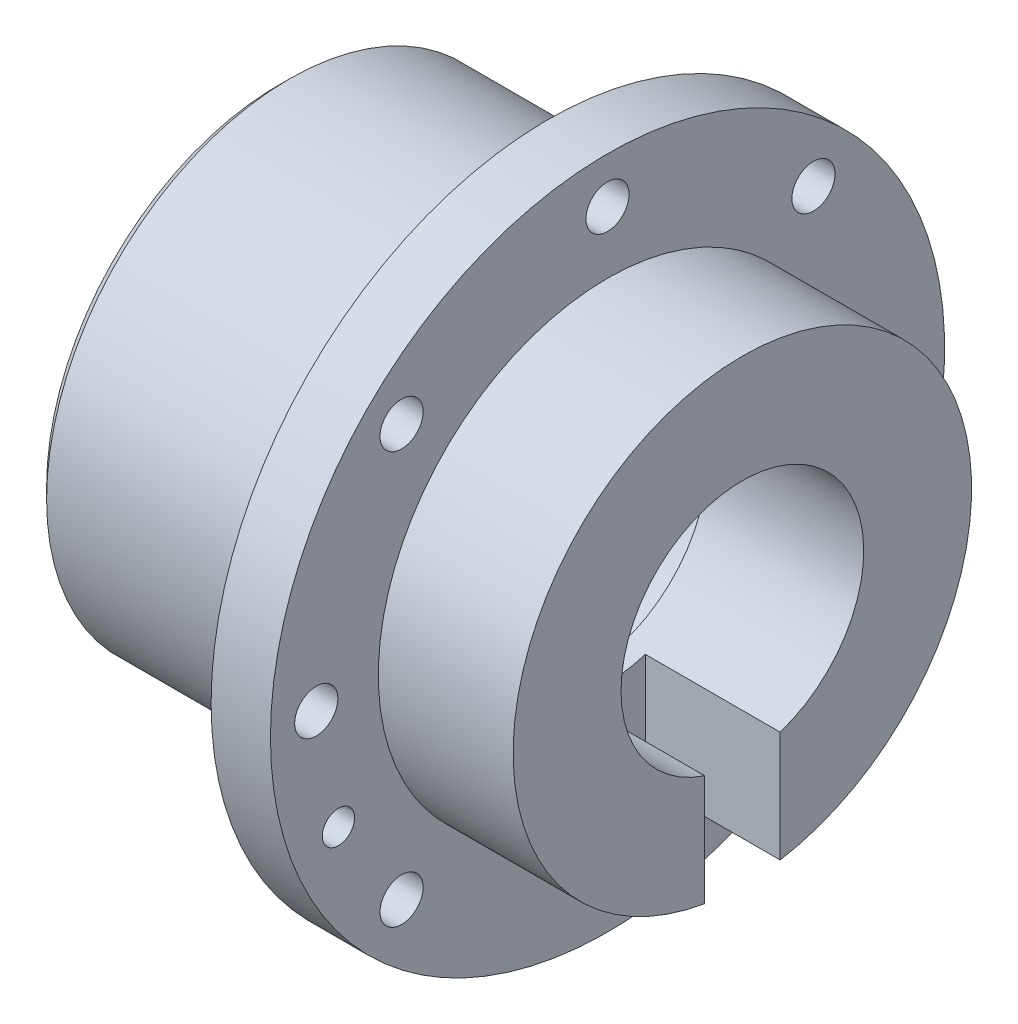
ISO-10303-21;
HEADER;
FILE_DESCRIPTION(('STEP AP214'),'2;1');
FILE_NAME('part.step','',(''),(''),'','','');
FILE_SCHEMA(('AUTOMOTIVE_DESIGN { 1 0 10303 214 1 1 1 1 }'));
ENDSEC;
DATA;
#1=APPLICATION_CONTEXT('core data for automotive mechanical design processes');
#2=APPLICATION_PROTOCOL_DEFINITION('international standard','automotive_design',2000,#1);
#3=PRODUCT_CONTEXT('',#1,'mechanical');
#4=PRODUCT('Part','Part','',(#3));
#5=PRODUCT_RELATED_PRODUCT_CATEGORY('part','',(#4));
#6=PRODUCT_DEFINITION_FORMATION('','',#4);
#7=PRODUCT_DEFINITION_CONTEXT('part definition',#1,'design');
#8=PRODUCT_DEFINITION('design','',#6,#7);
#9=PRODUCT_DEFINITION_SHAPE('','',#8);
#10=(LENGTH_UNIT() NAMED_UNIT(*) SI_UNIT(.MILLI.,.METRE.));
#11=(NAMED_UNIT(*) PLANE_ANGLE_UNIT() SI_UNIT($,.RADIAN.));
#12=(NAMED_UNIT(*) SI_UNIT($,.STERADIAN.) SOLID_ANGLE_UNIT());
#13=UNCERTAINTY_MEASURE_WITH_UNIT(LENGTH_MEASURE(1.E-05),#10,'distance_accuracy_value','');
#14=(GEOMETRIC_REPRESENTATION_CONTEXT(3) GLOBAL_UNCERTAINTY_ASSIGNED_CONTEXT((#13)) GLOBAL_UNIT_ASSIGNED_CONTEXT((#10,
#11,#12)) REPRESENTATION_CONTEXT('',''));
#15=CARTESIAN_POINT('',(0.,0.,0.));
#16=DIRECTION('',(0.,0.,1.));
#17=DIRECTION('',(1.,0.,0.));
#18=AXIS2_PLACEMENT_3D('',#15,#16,#17);
#19=CARTESIAN_POINT('',(59.2952543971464,62.5,0.));
#20=DIRECTION('',(-1.,0.,0.));
#21=DIRECTION('',(0.,0.,1.));
#22=AXIS2_PLACEMENT_3D('',#19,#20,#21);
#23=PLANE('',#22);
#24=CARTESIAN_POINT('',(59.2952543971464,38.1837661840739,-38.1837661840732));
#25=DIRECTION('',(1.,0.,0.));
#26=DIRECTION('',(0.,0.,-1.));
#27=AXIS2_PLACEMENT_3D('',#24,#25,#26);
#28=CIRCLE('',#27,3.99999999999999);
#29=CARTESIAN_POINT('',(59.2952543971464,38.1837661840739,-42.1837661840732));
#30=VERTEX_POINT('',#29);
#31=EDGE_CURVE('E233',#30,#30,#28,.T.);
#32=ORIENTED_EDGE('',*,*,#31,.F.);
#33=EDGE_LOOP('',(#32));
#34=FACE_BOUND('',#33,.T.);
#35=CARTESIAN_POINT('',(59.2952543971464,-38.1837661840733,-38.1837661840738));
#36=DIRECTION('',(1.,0.,0.));
#37=DIRECTION('',(0.,0.,-1.));
#38=AXIS2_PLACEMENT_3D('',#35,#36,#37);
#39=CIRCLE('',#38,3.99999999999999);
#40=CARTESIAN_POINT('',(59.2952543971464,-38.1837661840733,-42.1837661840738));
#41=VERTEX_POINT('',#40);
#42=EDGE_CURVE('E243',#41,#41,#39,.T.);
#43=ORIENTED_EDGE('',*,*,#42,.F.);
#44=EDGE_LOOP('',(#43));
#45=FACE_BOUND('',#44,.T.);
#46=CARTESIAN_POINT('',(59.2952543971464,38.1837661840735,38.1837661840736));
#47=DIRECTION('',(1.,0.,0.));
#48=DIRECTION('',(0.,0.,-1.));
#49=AXIS2_PLACEMENT_3D('',#46,#47,#48);
#50=CIRCLE('',#49,3.99999999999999);
#51=CARTESIAN_POINT('',(59.2952543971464,38.1837661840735,34.1837661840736));
#52=VERTEX_POINT('',#51);
#53=EDGE_CURVE('E257',#52,#52,#50,.T.);
#54=ORIENTED_EDGE('',*,*,#53,.F.);
#55=EDGE_LOOP('',(#54));
#56=FACE_BOUND('',#55,.T.);
#57=CARTESIAN_POINT('',(59.2952543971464,54.,0.));
#58=DIRECTION('',(1.,0.,0.));
#59=DIRECTION('',(0.,0.,-1.));
#60=AXIS2_PLACEMENT_3D('',#57,#58,#59);
#61=CIRCLE('',#60,4.);
#62=CARTESIAN_POINT('',(59.2952543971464,54.,-4.));
#63=VERTEX_POINT('',#62);
#64=EDGE_CURVE('E263',#63,#63,#61,.T.);
#65=ORIENTED_EDGE('',*,*,#64,.F.);
#66=EDGE_LOOP('',(#65));
#67=FACE_BOUND('',#66,.T.);
#68=DIRECTION('',(0.,-1.,0.));
#69=VECTOR('',#68,1.);
#70=CARTESIAN_POINT('',(59.2952543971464,-13.1016719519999,7.));
#71=LINE('',#70,#69);
#72=CARTESIAN_POINT('',(59.2952543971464,-21.3834047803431,7.));
#73=VERTEX_POINT('',#72);
#74=CARTESIAN_POINT('',(59.2952543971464,-41.9195658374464,6.99999999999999));
#75=VERTEX_POINT('',#74);
#76=EDGE_CURVE('E79',#73,#75,#71,.T.);
#77=ORIENTED_EDGE('',*,*,#76,.T.);
#78=CARTESIAN_POINT('',(59.2952543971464,0.,0.));
#79=DIRECTION('',(-1.,0.,0.));
#80=DIRECTION('',(0.,0.,1.));
#81=AXIS2_PLACEMENT_3D('',#78,#79,#80);
#82=CIRCLE('',#81,42.5);
#83=CARTESIAN_POINT('',(59.2952543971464,-41.9195658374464,-7.00000000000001));
#84=VERTEX_POINT('',#83);
#85=EDGE_CURVE('E99',#75,#84,#82,.T.);
#86=ORIENTED_EDGE('',*,*,#85,.T.);
#87=DIRECTION('',(0.,1.,0.));
#88=VECTOR('',#87,1.);
#89=CARTESIAN_POINT('',(59.2952543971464,-13.1016719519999,-7.));
#90=LINE('',#89,#88);
#91=CARTESIAN_POINT('',(59.2952543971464,-21.3834047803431,-7.));
#92=VERTEX_POINT('',#91);
#93=EDGE_CURVE('E51',#84,#92,#90,.T.);
#94=ORIENTED_EDGE('',*,*,#93,.T.);
#95=CARTESIAN_POINT('',(59.2952543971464,0.,0.));
#96=DIRECTION('',(1.,0.,0.));
#97=DIRECTION('',(0.,0.,-1.));
#98=AXIS2_PLACEMENT_3D('',#95,#96,#97);
#99=CIRCLE('',#98,22.5);
#100=EDGE_CURVE('E113',#92,#73,#99,.F.);
#101=ORIENTED_EDGE('',*,*,#100,.T.);
#102=EDGE_LOOP('',(#77,#86,#94,#101));
#103=FACE_BOUND('',#102,.T.);
#104=CARTESIAN_POINT('',(59.2952543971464,0.,0.));
#105=DIRECTION('',(-1.,0.,0.));
#106=DIRECTION('',(0.,0.,1.));
#107=AXIS2_PLACEMENT_3D('',#104,#105,#106);
#108=CIRCLE('',#107,62.5);
#109=CARTESIAN_POINT('',(59.2952543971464,0.,62.5));
#110=VERTEX_POINT('',#109);
#111=EDGE_CURVE('E107',#110,#110,#108,.T.);
#112=ORIENTED_EDGE('',*,*,#111,.F.);
#113=EDGE_LOOP('',(#112));
#114=FACE_BOUND('',#113,.T.);
#115=CARTESIAN_POINT('',(59.2952543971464,-1.405784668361E-13,54.));
#116=DIRECTION('',(1.,0.,0.));
#117=DIRECTION('',(0.,0.,-1.));
#118=AXIS2_PLACEMENT_3D('',#115,#116,#117);
#119=CIRCLE('',#118,3.99999999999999);
#120=CARTESIAN_POINT('',(59.2952543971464,-1.405784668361E-13,50.));
#121=VERTEX_POINT('',#120);
#122=EDGE_CURVE('E209',#121,#121,#119,.T.);
#123=ORIENTED_EDGE('',*,*,#122,.F.);
#124=EDGE_LOOP('',(#123));
#125=FACE_BOUND('',#124,.T.);
#126=CARTESIAN_POINT('',(59.2952543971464,-38.1837661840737,38.1837661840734));
#127=DIRECTION('',(1.,0.,0.));
#128=DIRECTION('',(0.,0.,-1.));
#129=AXIS2_PLACEMENT_3D('',#126,#127,#128);
#130=CIRCLE('',#129,4.);
#131=CARTESIAN_POINT('',(59.2952543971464,-38.1837661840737,34.1837661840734));
#132=VERTEX_POINT('',#131);
#133=EDGE_CURVE('E213',#132,#132,#130,.T.);
#134=ORIENTED_EDGE('',*,*,#133,.F.);
#135=EDGE_LOOP('',(#134));
#136=FACE_BOUND('',#135,.T.);
#137=CARTESIAN_POINT('',(59.2952543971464,4.217354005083E-13,-54.));
#138=DIRECTION('',(1.,0.,0.));
#139=DIRECTION('',(0.,0.,-1.));
#140=AXIS2_PLACEMENT_3D('',#137,#138,#139);
#141=CIRCLE('',#140,3.99999999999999);
#142=CARTESIAN_POINT('',(59.2952543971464,4.217354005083E-13,-58.));
#143=VERTEX_POINT('',#142);
#144=EDGE_CURVE('E217',#143,#143,#141,.T.);
#145=ORIENTED_EDGE('',*,*,#144,.F.);
#146=EDGE_LOOP('',(#145));
#147=FACE_BOUND('',#146,.T.);
#148=CARTESIAN_POINT('',(59.2952543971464,-20.6649053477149,49.8894947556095));
#149=DIRECTION('',(1.,0.,0.));
#150=DIRECTION('',(0.,0.,-1.));
#151=AXIS2_PLACEMENT_3D('',#148,#149,#150);
#152=CIRCLE('',#151,2.99999999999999);
#153=CARTESIAN_POINT('',(59.2952543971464,-20.6649053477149,46.8894947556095));
#154=VERTEX_POINT('',#153);
#155=EDGE_CURVE('E221',#154,#154,#152,.T.);
#156=ORIENTED_EDGE('',*,*,#155,.F.);
#157=EDGE_LOOP('',(#156));
#158=FACE_BOUND('',#157,.T.);
#159=CARTESIAN_POINT('',(59.2952543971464,-20.6649053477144,-49.8894947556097));
#160=DIRECTION('',(1.,0.,0.));
#161=DIRECTION('',(0.,0.,-1.));
#162=AXIS2_PLACEMENT_3D('',#159,#160,#161);
#163=CIRCLE('',#162,2.99999999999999);
#164=CARTESIAN_POINT('',(59.2952543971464,-20.6649053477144,-52.8894947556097));
#165=VERTEX_POINT('',#164);
#166=EDGE_CURVE('E224',#165,#165,#163,.T.);
#167=ORIENTED_EDGE('',*,*,#166,.F.);
#168=EDGE_LOOP('',(#167));
#169=FACE_BOUND('',#168,.T.);
#170=ADVANCED_FACE('F35',(#34,#45,#56,#67,#103,#114,#125,#136,#147,#158,#169),#23,.F.);
#171=CARTESIAN_POINT('',(48.2952543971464,45.,0.));
#172=DIRECTION('',(1.,0.,0.));
#173=DIRECTION('',(0.,0.,-1.));
#174=AXIS2_PLACEMENT_3D('',#171,#172,#173);
#175=PLANE('',#174);
#176=CARTESIAN_POINT('',(48.2952543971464,-20.6649053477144,-49.8894947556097));
#177=DIRECTION('',(1.,0.,0.));
#178=DIRECTION('',(0.,0.,-1.));
#179=AXIS2_PLACEMENT_3D('',#176,#177,#178);
#180=CIRCLE('',#179,2.99999999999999);
#181=CARTESIAN_POINT('',(48.2952543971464,-20.6649053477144,-52.8894947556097));
#182=VERTEX_POINT('',#181);
#183=EDGE_CURVE('E39',#182,#182,#180,.T.);
#184=ORIENTED_EDGE('',*,*,#183,.T.);
#185=EDGE_LOOP('',(#184));
#186=FACE_BOUND('',#185,.T.);
#187=CARTESIAN_POINT('',(48.2952543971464,-20.6649053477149,49.8894947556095));
#188=DIRECTION('',(1.,0.,0.));
#189=DIRECTION('',(0.,0.,-1.));
#190=AXIS2_PLACEMENT_3D('',#187,#188,#189);
#191=CIRCLE('',#190,2.99999999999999);
#192=CARTESIAN_POINT('',(48.2952543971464,-20.6649053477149,46.8894947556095));
#193=VERTEX_POINT('',#192);
#194=EDGE_CURVE('E230',#193,#193,#191,.T.);
#195=ORIENTED_EDGE('',*,*,#194,.T.);
#196=EDGE_LOOP('',(#195));
#197=FACE_BOUND('',#196,.T.);
#198=CARTESIAN_POINT('',(48.2952543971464,38.1837661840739,-38.1837661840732));
#199=DIRECTION('',(1.,0.,0.));
#200=DIRECTION('',(0.,0.,-1.));
#201=AXIS2_PLACEMENT_3D('',#198,#199,#200);
#202=CIRCLE('',#201,3.99999999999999);
#203=CARTESIAN_POINT('',(48.2952543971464,38.1837661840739,-42.1837661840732));
#204=VERTEX_POINT('',#203);
#205=EDGE_CURVE('E236',#204,#204,#202,.T.);
#206=ORIENTED_EDGE('',*,*,#205,.T.);
#207=EDGE_LOOP('',(#206));
#208=FACE_BOUND('',#207,.T.);
#209=CARTESIAN_POINT('',(48.2952543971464,4.217354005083E-13,-54.));
#210=DIRECTION('',(1.,0.,0.));
#211=DIRECTION('',(0.,0.,-1.));
#212=AXIS2_PLACEMENT_3D('',#209,#210,#211);
#213=CIRCLE('',#212,3.99999999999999);
#214=CARTESIAN_POINT('',(48.2952543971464,4.217354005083E-13,-58.));
#215=VERTEX_POINT('',#214);
#216=EDGE_CURVE('E240',#215,#215,#213,.T.);
#217=ORIENTED_EDGE('',*,*,#216,.T.);
#218=EDGE_LOOP('',(#217));
#219=FACE_BOUND('',#218,.T.);
#220=CARTESIAN_POINT('',(48.2952543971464,-38.1837661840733,-38.1837661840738));
#221=DIRECTION('',(1.,0.,0.));
#222=DIRECTION('',(0.,0.,-1.));
#223=AXIS2_PLACEMENT_3D('',#220,#221,#222);
#224=CIRCLE('',#223,3.99999999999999);
#225=CARTESIAN_POINT('',(48.2952543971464,-38.1837661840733,-42.1837661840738));
#226=VERTEX_POINT('',#225);
#227=EDGE_CURVE('E246',#226,#226,#224,.T.);
#228=ORIENTED_EDGE('',*,*,#227,.T.);
#229=EDGE_LOOP('',(#228));
#230=FACE_BOUND('',#229,.T.);
#231=CARTESIAN_POINT('',(48.2952543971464,-38.1837661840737,38.1837661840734));
#232=DIRECTION('',(1.,0.,0.));
#233=DIRECTION('',(0.,0.,-1.));
#234=AXIS2_PLACEMENT_3D('',#231,#232,#233);
#235=CIRCLE('',#234,3.99999999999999);
#236=CARTESIAN_POINT('',(48.2952543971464,-38.1837661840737,34.1837661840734));
#237=VERTEX_POINT('',#236);
#238=EDGE_CURVE('E250',#237,#237,#235,.T.);
#239=ORIENTED_EDGE('',*,*,#238,.T.);
#240=EDGE_LOOP('',(#239));
#241=FACE_BOUND('',#240,.T.);
#242=CARTESIAN_POINT('',(48.2952543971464,-1.405784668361E-13,54.));
#243=DIRECTION('',(1.,0.,0.));
#244=DIRECTION('',(0.,0.,-1.));
#245=AXIS2_PLACEMENT_3D('',#242,#243,#244);
#246=CIRCLE('',#245,3.99999999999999);
#247=CARTESIAN_POINT('',(48.2952543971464,-1.405784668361E-13,50.));
#248=VERTEX_POINT('',#247);
#249=EDGE_CURVE('E254',#248,#248,#246,.T.);
#250=ORIENTED_EDGE('',*,*,#249,.T.);
#251=EDGE_LOOP('',(#250));
#252=FACE_BOUND('',#251,.T.);
#253=CARTESIAN_POINT('',(48.2952543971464,38.1837661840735,38.1837661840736));
#254=DIRECTION('',(1.,0.,0.));
#255=DIRECTION('',(0.,0.,-1.));
#256=AXIS2_PLACEMENT_3D('',#253,#254,#255);
#257=CIRCLE('',#256,3.99999999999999);
#258=CARTESIAN_POINT('',(48.2952543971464,38.1837661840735,34.1837661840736));
#259=VERTEX_POINT('',#258);
#260=EDGE_CURVE('E260',#259,#259,#257,.T.);
#261=ORIENTED_EDGE('',*,*,#260,.T.);
#262=EDGE_LOOP('',(#261));
#263=FACE_BOUND('',#262,.T.);
#264=CARTESIAN_POINT('',(48.2952543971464,54.,0.));
#265=DIRECTION('',(1.,0.,0.));
#266=DIRECTION('',(0.,0.,-1.));
#267=AXIS2_PLACEMENT_3D('',#264,#265,#266);
#268=CIRCLE('',#267,3.99999999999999);
#269=CARTESIAN_POINT('',(48.2952543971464,54.,-3.99999999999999));
#270=VERTEX_POINT('',#269);
#271=EDGE_CURVE('E92',#270,#270,#268,.T.);
#272=ORIENTED_EDGE('',*,*,#271,.T.);
#273=EDGE_LOOP('',(#272));
#274=FACE_BOUND('',#273,.T.);
#275=CARTESIAN_POINT('',(48.2952543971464,0.,0.));
#276=DIRECTION('',(-1.,0.,0.));
#277=DIRECTION('',(0.,0.,1.));
#278=AXIS2_PLACEMENT_3D('',#275,#276,#277);
#279=CIRCLE('',#278,45.);
#280=CARTESIAN_POINT('',(48.2952543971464,0.,45.));
#281=VERTEX_POINT('',#280);
#282=EDGE_CURVE('E123',#281,#281,#279,.T.);
#283=ORIENTED_EDGE('',*,*,#282,.F.);
#284=EDGE_LOOP('',(#283));
#285=FACE_BOUND('',#284,.T.);
#286=CARTESIAN_POINT('',(48.2952543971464,0.,0.));
#287=DIRECTION('',(-1.,0.,0.));
#288=DIRECTION('',(0.,0.,1.));
#289=AXIS2_PLACEMENT_3D('',#286,#287,#288);
#290=CIRCLE('',#289,62.5);
#291=CARTESIAN_POINT('',(48.2952543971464,0.,62.5));
#292=VERTEX_POINT('',#291);
#293=EDGE_CURVE('E110',#292,#292,#290,.T.);
#294=ORIENTED_EDGE('',*,*,#293,.T.);
#295=EDGE_LOOP('',(#294));
#296=FACE_BOUND('',#295,.T.);
#297=ADVANCED_FACE('F37',(#186,#197,#208,#219,#230,#241,#252,#263,#274,#285,#296),#175,.F.);
#298=CARTESIAN_POINT('',(0.,0.,0.));
#299=DIRECTION('',(-1.,0.,0.));
#300=DIRECTION('',(0.,0.,1.));
#301=AXIS2_PLACEMENT_3D('',#298,#299,#300);
#302=CYLINDRICAL_SURFACE('',#301,62.5);
#303=ORIENTED_EDGE('',*,*,#293,.F.);
#304=EDGE_LOOP('',(#303));
#305=FACE_BOUND('',#304,.T.);
#306=ORIENTED_EDGE('',*,*,#111,.T.);
#307=EDGE_LOOP('',(#306));
#308=FACE_BOUND('',#307,.T.);
#309=ADVANCED_FACE('F195',(#305,#308),#302,.T.);
#310=CARTESIAN_POINT('',(0.,0.,0.));
#311=DIRECTION('',(-1.,0.,0.));
#312=DIRECTION('',(0.,0.,1.));
#313=AXIS2_PLACEMENT_3D('',#310,#311,#312);
#314=CYLINDRICAL_SURFACE('',#313,42.5);
#315=ORIENTED_EDGE('',*,*,#85,.F.);
#316=DIRECTION('',(-1.,0.,0.));
#317=VECTOR('',#316,1.);
#318=CARTESIAN_POINT('',(0.,-41.9195658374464,6.99999999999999));
#319=LINE('',#318,#317);
#320=CARTESIAN_POINT('',(84.2952543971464,-41.9195658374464,6.99999999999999));
#321=VERTEX_POINT('',#320);
#322=EDGE_CURVE('E120',#75,#321,#319,.F.);
#323=ORIENTED_EDGE('',*,*,#322,.T.);
#324=CARTESIAN_POINT('',(84.2952543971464,0.,0.));
#325=DIRECTION('',(-1.,0.,0.));
#326=DIRECTION('',(0.,0.,1.));
#327=AXIS2_PLACEMENT_3D('',#324,#325,#326);
#328=CIRCLE('',#327,42.5);
#329=CARTESIAN_POINT('',(84.2952543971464,-41.9195658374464,-7.00000000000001));
#330=VERTEX_POINT('',#329);
#331=EDGE_CURVE('E90',#321,#330,#328,.T.);
#332=ORIENTED_EDGE('',*,*,#331,.T.);
#333=DIRECTION('',(-1.,0.,0.));
#334=VECTOR('',#333,1.);
#335=CARTESIAN_POINT('',(0.,-41.9195658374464,-7.00000000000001));
#336=LINE('',#335,#334);
#337=EDGE_CURVE('E121',#330,#84,#336,.T.);
#338=ORIENTED_EDGE('',*,*,#337,.T.);
#339=EDGE_LOOP('',(#315,#323,#332,#338));
#340=FACE_BOUND('',#339,.T.);
#341=ADVANCED_FACE('F119',(#340),#314,.T.);
#342=CARTESIAN_POINT('',(84.2952543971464,42.5,0.));
#343=DIRECTION('',(-1.,0.,0.));
#344=DIRECTION('',(0.,0.,1.));
#345=AXIS2_PLACEMENT_3D('',#342,#343,#344);
#346=PLANE('',#345);
#347=ORIENTED_EDGE('',*,*,#331,.F.);
#348=DIRECTION('',(0.,-1.,0.));
#349=VECTOR('',#348,1.);
#350=CARTESIAN_POINT('',(84.2952543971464,-13.1016719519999,7.));
#351=LINE('',#350,#349);
#352=CARTESIAN_POINT('',(84.2952543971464,-21.3834047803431,7.));
#353=VERTEX_POINT('',#352);
#354=EDGE_CURVE('E76',#353,#321,#351,.T.);
#355=ORIENTED_EDGE('',*,*,#354,.F.);
#356=CARTESIAN_POINT('',(84.2952543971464,0.,0.));
#357=DIRECTION('',(-1.,0.,0.));
#358=DIRECTION('',(0.,0.,1.));
#359=AXIS2_PLACEMENT_3D('',#356,#357,#358);
#360=CIRCLE('',#359,22.5);
#361=CARTESIAN_POINT('',(84.2952543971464,-21.3834047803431,-7.));
#362=VERTEX_POINT('',#361);
#363=EDGE_CURVE('E88',#353,#362,#360,.T.);
#364=ORIENTED_EDGE('',*,*,#363,.T.);
#365=DIRECTION('',(0.,1.,0.));
#366=VECTOR('',#365,1.);
#367=CARTESIAN_POINT('',(84.2952543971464,-13.1016719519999,-7.));
#368=LINE('',#367,#366);
#369=EDGE_CURVE('E91',#330,#362,#368,.T.);
#370=ORIENTED_EDGE('',*,*,#369,.F.);
#371=EDGE_LOOP('',(#347,#355,#364,#370));
#372=FACE_BOUND('',#371,.T.);
#373=ADVANCED_FACE('F86',(#372),#346,.F.);
#374=CARTESIAN_POINT('',(0.,0.,0.));
#375=DIRECTION('',(-1.,0.,0.));
#376=DIRECTION('',(0.,0.,1.));
#377=AXIS2_PLACEMENT_3D('',#374,#375,#376);
#378=CYLINDRICAL_SURFACE('',#377,22.5);
#379=ORIENTED_EDGE('',*,*,#363,.F.);
#380=DIRECTION('',(-1.,0.,0.));
#381=VECTOR('',#380,1.);
#382=CARTESIAN_POINT('',(0.,-21.3834047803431,7.));
#383=LINE('',#382,#381);
#384=EDGE_CURVE('E11',#353,#73,#383,.T.);
#385=ORIENTED_EDGE('',*,*,#384,.T.);
#386=ORIENTED_EDGE('',*,*,#100,.F.);
#387=DIRECTION('',(-1.,0.,0.));
#388=VECTOR('',#387,1.);
#389=CARTESIAN_POINT('',(0.,-21.3834047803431,-7.));
#390=LINE('',#389,#388);
#391=EDGE_CURVE('E44',#92,#362,#390,.F.);
#392=ORIENTED_EDGE('',*,*,#391,.T.);
#393=EDGE_LOOP('',(#379,#385,#386,#392));
#394=FACE_BOUND('',#393,.T.);
#395=CARTESIAN_POINT('',(55.3048733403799,0.,0.));
#396=DIRECTION('',(-1.,0.,0.));
#397=DIRECTION('',(0.,0.,1.));
#398=AXIS2_PLACEMENT_3D('',#395,#396,#397);
#399=CIRCLE('',#398,22.5);
#400=CARTESIAN_POINT('',(55.3048733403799,0.,22.5));
#401=VERTEX_POINT('',#400);
#402=EDGE_CURVE('E97',#401,#401,#399,.T.);
#403=ORIENTED_EDGE('',*,*,#402,.T.);
#404=EDGE_LOOP('',(#403));
#405=FACE_BOUND('',#404,.T.);
#406=ADVANCED_FACE('F95',(#394,#405),#378,.F.);
#407=CARTESIAN_POINT('',(52.4181219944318,0.,0.));
#408=DIRECTION('',(-1.,0.,0.));
#409=DIRECTION('',(0.,0.,1.));
#410=AXIS2_PLACEMENT_3D('',#407,#408,#409);
#411=CONICAL_SURFACE('',#410,27.5,1.0471975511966);
#412=ORIENTED_EDGE('',*,*,#402,.F.);
#413=EDGE_LOOP('',(#412));
#414=FACE_BOUND('',#413,.T.);
#415=CARTESIAN_POINT('',(52.4181219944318,0.,0.));
#416=DIRECTION('',(-1.,0.,0.));
#417=DIRECTION('',(0.,0.,1.));
#418=AXIS2_PLACEMENT_3D('',#415,#416,#417);
#419=CIRCLE('',#418,27.5);
#420=CARTESIAN_POINT('',(52.4181219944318,0.,27.5));
#421=VERTEX_POINT('',#420);
#422=EDGE_CURVE('E102',#421,#421,#419,.T.);
#423=ORIENTED_EDGE('',*,*,#422,.T.);
#424=EDGE_LOOP('',(#423));
#425=FACE_BOUND('',#424,.T.);
#426=ADVANCED_FACE('F149',(#414,#425),#411,.F.);
#427=CARTESIAN_POINT('',(0.,0.,0.));
#428=DIRECTION('',(-1.,0.,0.));
#429=DIRECTION('',(0.,0.,1.));
#430=AXIS2_PLACEMENT_3D('',#427,#428,#429);
#431=CYLINDRICAL_SURFACE('',#430,27.5);
#432=ORIENTED_EDGE('',*,*,#422,.F.);
#433=EDGE_LOOP('',(#432));
#434=FACE_BOUND('',#433,.T.);
#435=CARTESIAN_POINT('',(26.2952543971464,0.,0.));
#436=DIRECTION('',(-1.,0.,0.));
#437=DIRECTION('',(0.,0.,1.));
#438=AXIS2_PLACEMENT_3D('',#435,#436,#437);
#439=CIRCLE('',#438,27.5);
#440=CARTESIAN_POINT('',(26.2952543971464,0.,27.5));
#441=VERTEX_POINT('',#440);
#442=EDGE_CURVE('E144',#441,#441,#439,.T.);
#443=ORIENTED_EDGE('',*,*,#442,.T.);
#444=EDGE_LOOP('',(#443));
#445=FACE_BOUND('',#444,.T.);
#446=ADVANCED_FACE('F151',(#434,#445),#431,.F.);
#447=CARTESIAN_POINT('',(26.2952543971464,27.5,0.));
#448=DIRECTION('',(1.,0.,0.));
#449=DIRECTION('',(0.,0.,-1.));
#450=AXIS2_PLACEMENT_3D('',#447,#448,#449);
#451=PLANE('',#450);
#452=ORIENTED_EDGE('',*,*,#442,.F.);
#453=EDGE_LOOP('',(#452));
#454=FACE_BOUND('',#453,.T.);
#455=CARTESIAN_POINT('',(26.2952543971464,0.,0.));
#456=DIRECTION('',(-1.,0.,0.));
#457=DIRECTION('',(0.,0.,1.));
#458=AXIS2_PLACEMENT_3D('',#455,#456,#457);
#459=CIRCLE('',#458,32.5);
#460=CARTESIAN_POINT('',(26.2952543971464,0.,32.5));
#461=VERTEX_POINT('',#460);
#462=EDGE_CURVE('E141',#461,#461,#459,.T.);
#463=ORIENTED_EDGE('',*,*,#462,.T.);
#464=EDGE_LOOP('',(#463));
#465=FACE_BOUND('',#464,.T.);
#466=ADVANCED_FACE('F154',(#454,#465),#451,.F.);
#467=CARTESIAN_POINT('',(0.,0.,0.));
#468=DIRECTION('',(-1.,0.,0.));
#469=DIRECTION('',(0.,0.,1.));
#470=AXIS2_PLACEMENT_3D('',#467,#468,#469);
#471=CYLINDRICAL_SURFACE('',#470,32.5);
#472=ORIENTED_EDGE('',*,*,#462,.F.);
#473=EDGE_LOOP('',(#472));
#474=FACE_BOUND('',#473,.T.);
#475=CARTESIAN_POINT('',(5.7952543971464,0.,0.));
#476=DIRECTION('',(-1.,0.,0.));
#477=DIRECTION('',(0.,0.,1.));
#478=AXIS2_PLACEMENT_3D('',#475,#476,#477);
#479=CIRCLE('',#478,32.5);
#480=CARTESIAN_POINT('',(5.7952543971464,0.,32.5));
#481=VERTEX_POINT('',#480);
#482=EDGE_CURVE('E138',#481,#481,#479,.T.);
#483=ORIENTED_EDGE('',*,*,#482,.T.);
#484=EDGE_LOOP('',(#483));
#485=FACE_BOUND('',#484,.T.);
#486=ADVANCED_FACE('F160',(#474,#485),#471,.F.);
#487=CARTESIAN_POINT('',(-1.7047456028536,0.,0.));
#488=DIRECTION('',(-1.,0.,0.));
#489=DIRECTION('',(0.,0.,1.));
#490=AXIS2_PLACEMENT_3D('',#487,#488,#489);
#491=CONICAL_SURFACE('',#490,40.,0.785398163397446);
#492=ORIENTED_EDGE('',*,*,#482,.F.);
#493=EDGE_LOOP('',(#492));
#494=FACE_BOUND('',#493,.T.);
#495=CARTESIAN_POINT('',(-1.7047456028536,0.,0.));
#496=DIRECTION('',(-1.,0.,0.));
#497=DIRECTION('',(0.,0.,1.));
#498=AXIS2_PLACEMENT_3D('',#495,#496,#497);
#499=CIRCLE('',#498,40.);
#500=CARTESIAN_POINT('',(-1.7047456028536,0.,40.));
#501=VERTEX_POINT('',#500);
#502=EDGE_CURVE('E135',#501,#501,#499,.T.);
#503=ORIENTED_EDGE('',*,*,#502,.T.);
#504=EDGE_LOOP('',(#503));
#505=FACE_BOUND('',#504,.T.);
#506=ADVANCED_FACE('F166',(#494,#505),#491,.F.);
#507=CARTESIAN_POINT('',(-1.7047456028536,40.,0.));
#508=DIRECTION('',(1.,0.,0.));
#509=DIRECTION('',(0.,0.,-1.));
#510=AXIS2_PLACEMENT_3D('',#507,#508,#509);
#511=PLANE('',#510);
#512=ORIENTED_EDGE('',*,*,#502,.F.);
#513=EDGE_LOOP('',(#512));
#514=FACE_BOUND('',#513,.T.);
#515=CARTESIAN_POINT('',(-1.7047456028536,0.,0.));
#516=DIRECTION('',(-1.,0.,0.));
#517=DIRECTION('',(0.,0.,1.));
#518=AXIS2_PLACEMENT_3D('',#515,#516,#517);
#519=CIRCLE('',#518,43.);
#520=CARTESIAN_POINT('',(-1.7047456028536,0.,43.));
#521=VERTEX_POINT('',#520);
#522=EDGE_CURVE('E132',#521,#521,#519,.T.);
#523=ORIENTED_EDGE('',*,*,#522,.T.);
#524=EDGE_LOOP('',(#523));
#525=FACE_BOUND('',#524,.T.);
#526=ADVANCED_FACE('F172',(#514,#525),#511,.F.);
#527=CARTESIAN_POINT('',(0.295254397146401,0.,0.));
#528=DIRECTION('',(1.,0.,0.));
#529=DIRECTION('',(0.,0.,-1.));
#530=AXIS2_PLACEMENT_3D('',#527,#528,#529);
#531=CONICAL_SURFACE('',#530,45.,0.785398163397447);
#532=ORIENTED_EDGE('',*,*,#522,.F.);
#533=EDGE_LOOP('',(#532));
#534=FACE_BOUND('',#533,.T.);
#535=CARTESIAN_POINT('',(0.295254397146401,0.,0.));
#536=DIRECTION('',(-1.,0.,0.));
#537=DIRECTION('',(0.,0.,1.));
#538=AXIS2_PLACEMENT_3D('',#535,#536,#537);
#539=CIRCLE('',#538,45.);
#540=CARTESIAN_POINT('',(0.295254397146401,0.,45.));
#541=VERTEX_POINT('',#540);
#542=EDGE_CURVE('E129',#541,#541,#539,.T.);
#543=ORIENTED_EDGE('',*,*,#542,.T.);
#544=EDGE_LOOP('',(#543));
#545=FACE_BOUND('',#544,.T.);
#546=ADVANCED_FACE('F178',(#534,#545),#531,.T.);
#547=CARTESIAN_POINT('',(0.,0.,0.));
#548=DIRECTION('',(-1.,0.,0.));
#549=DIRECTION('',(0.,0.,1.));
#550=AXIS2_PLACEMENT_3D('',#547,#548,#549);
#551=CYLINDRICAL_SURFACE('',#550,45.);
#552=ORIENTED_EDGE('',*,*,#542,.F.);
#553=EDGE_LOOP('',(#552));
#554=FACE_BOUND('',#553,.T.);
#555=ORIENTED_EDGE('',*,*,#282,.T.);
#556=EDGE_LOOP('',(#555));
#557=FACE_BOUND('',#556,.T.);
#558=ADVANCED_FACE('F184',(#554,#557),#551,.T.);
#559=CARTESIAN_POINT('',(59.2952543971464,-13.1016719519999,7.));
#560=DIRECTION('',(0.,0.,1.));
#561=DIRECTION('',(0.,-1.,0.));
#562=AXIS2_PLACEMENT_3D('',#559,#560,#561);
#563=PLANE('',#562);
#564=ORIENTED_EDGE('',*,*,#76,.F.);
#565=ORIENTED_EDGE('',*,*,#384,.F.);
#566=ORIENTED_EDGE('',*,*,#354,.T.);
#567=ORIENTED_EDGE('',*,*,#322,.F.);
#568=EDGE_LOOP('',(#564,#565,#566,#567));
#569=FACE_BOUND('',#568,.T.);
#570=ADVANCED_FACE('F75',(#569),#563,.F.);
#571=CARTESIAN_POINT('',(59.2952543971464,-13.1016719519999,-7.));
#572=DIRECTION('',(0.,0.,-1.));
#573=DIRECTION('',(0.,1.,0.));
#574=AXIS2_PLACEMENT_3D('',#571,#572,#573);
#575=PLANE('',#574);
#576=ORIENTED_EDGE('',*,*,#369,.T.);
#577=ORIENTED_EDGE('',*,*,#391,.F.);
#578=ORIENTED_EDGE('',*,*,#93,.F.);
#579=ORIENTED_EDGE('',*,*,#337,.F.);
#580=EDGE_LOOP('',(#576,#577,#578,#579));
#581=FACE_BOUND('',#580,.T.);
#582=ADVANCED_FACE('F268',(#581),#575,.F.);
#583=CARTESIAN_POINT('',(59.2952543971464,54.,0.));
#584=DIRECTION('',(1.,0.,0.));
#585=DIRECTION('',(0.,0.,-1.));
#586=AXIS2_PLACEMENT_3D('',#583,#584,#585);
#587=CYLINDRICAL_SURFACE('',#586,3.99999999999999);
#588=ORIENTED_EDGE('',*,*,#64,.T.);
#589=EDGE_LOOP('',(#588));
#590=FACE_BOUND('',#589,.T.);
#591=ORIENTED_EDGE('',*,*,#271,.F.);
#592=EDGE_LOOP('',(#591));
#593=FACE_BOUND('',#592,.T.);
#594=ADVANCED_FACE('F270',(#590,#593),#587,.F.);
#595=CARTESIAN_POINT('',(59.2952543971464,38.1837661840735,38.1837661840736));
#596=DIRECTION('',(1.,0.,0.));
#597=DIRECTION('',(0.,0.,-1.));
#598=AXIS2_PLACEMENT_3D('',#595,#596,#597);
#599=CYLINDRICAL_SURFACE('',#598,3.99999999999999);
#600=ORIENTED_EDGE('',*,*,#53,.T.);
#601=EDGE_LOOP('',(#600));
#602=FACE_BOUND('',#601,.T.);
#603=ORIENTED_EDGE('',*,*,#260,.F.);
#604=EDGE_LOOP('',(#603));
#605=FACE_BOUND('',#604,.T.);
#606=ADVANCED_FACE('F276',(#602,#605),#599,.F.);
#607=CARTESIAN_POINT('',(59.2952543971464,-1.405784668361E-13,54.));
#608=DIRECTION('',(1.,0.,0.));
#609=DIRECTION('',(0.,0.,-1.));
#610=AXIS2_PLACEMENT_3D('',#607,#608,#609);
#611=CYLINDRICAL_SURFACE('',#610,3.99999999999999);
#612=ORIENTED_EDGE('',*,*,#122,.T.);
#613=EDGE_LOOP('',(#612));
#614=FACE_BOUND('',#613,.T.);
#615=ORIENTED_EDGE('',*,*,#249,.F.);
#616=EDGE_LOOP('',(#615));
#617=FACE_BOUND('',#616,.T.);
#618=ADVANCED_FACE('F359',(#614,#617),#611,.F.);
#619=CARTESIAN_POINT('',(59.2952543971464,-38.1837661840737,38.1837661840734));
#620=DIRECTION('',(1.,0.,0.));
#621=DIRECTION('',(0.,0.,-1.));
#622=AXIS2_PLACEMENT_3D('',#619,#620,#621);
#623=CYLINDRICAL_SURFACE('',#622,3.99999999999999);
#624=ORIENTED_EDGE('',*,*,#133,.T.);
#625=EDGE_LOOP('',(#624));
#626=FACE_BOUND('',#625,.T.);
#627=ORIENTED_EDGE('',*,*,#238,.F.);
#628=EDGE_LOOP('',(#627));
#629=FACE_BOUND('',#628,.T.);
#630=ADVANCED_FACE('F368',(#626,#629),#623,.F.);
#631=CARTESIAN_POINT('',(59.2952543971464,-38.1837661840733,-38.1837661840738));
#632=DIRECTION('',(1.,0.,0.));
#633=DIRECTION('',(0.,0.,-1.));
#634=AXIS2_PLACEMENT_3D('',#631,#632,#633);
#635=CYLINDRICAL_SURFACE('',#634,3.99999999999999);
#636=ORIENTED_EDGE('',*,*,#42,.T.);
#637=EDGE_LOOP('',(#636));
#638=FACE_BOUND('',#637,.T.);
#639=ORIENTED_EDGE('',*,*,#227,.F.);
#640=EDGE_LOOP('',(#639));
#641=FACE_BOUND('',#640,.T.);
#642=ADVANCED_FACE('F378',(#638,#641),#635,.F.);
#643=CARTESIAN_POINT('',(59.2952543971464,4.217354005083E-13,-54.));
#644=DIRECTION('',(1.,0.,0.));
#645=DIRECTION('',(0.,0.,-1.));
#646=AXIS2_PLACEMENT_3D('',#643,#644,#645);
#647=CYLINDRICAL_SURFACE('',#646,3.99999999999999);
#648=ORIENTED_EDGE('',*,*,#144,.T.);
#649=EDGE_LOOP('',(#648));
#650=FACE_BOUND('',#649,.T.);
#651=ORIENTED_EDGE('',*,*,#216,.F.);
#652=EDGE_LOOP('',(#651));
#653=FACE_BOUND('',#652,.T.);
#654=ADVANCED_FACE('F388',(#650,#653),#647,.F.);
#655=CARTESIAN_POINT('',(59.2952543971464,38.1837661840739,-38.1837661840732));
#656=DIRECTION('',(1.,0.,0.));
#657=DIRECTION('',(0.,0.,-1.));
#658=AXIS2_PLACEMENT_3D('',#655,#656,#657);
#659=CYLINDRICAL_SURFACE('',#658,3.99999999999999);
#660=ORIENTED_EDGE('',*,*,#31,.T.);
#661=EDGE_LOOP('',(#660));
#662=FACE_BOUND('',#661,.T.);
#663=ORIENTED_EDGE('',*,*,#205,.F.);
#664=EDGE_LOOP('',(#663));
#665=FACE_BOUND('',#664,.T.);
#666=ADVANCED_FACE('F398',(#662,#665),#659,.F.);
#667=CARTESIAN_POINT('',(59.2952543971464,-20.6649053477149,49.8894947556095));
#668=DIRECTION('',(1.,0.,0.));
#669=DIRECTION('',(0.,0.,-1.));
#670=AXIS2_PLACEMENT_3D('',#667,#668,#669);
#671=CYLINDRICAL_SURFACE('',#670,2.99999999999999);
#672=ORIENTED_EDGE('',*,*,#155,.T.);
#673=EDGE_LOOP('',(#672));
#674=FACE_BOUND('',#673,.T.);
#675=ORIENTED_EDGE('',*,*,#194,.F.);
#676=EDGE_LOOP('',(#675));
#677=FACE_BOUND('',#676,.T.);
#678=ADVANCED_FACE('F408',(#674,#677),#671,.F.);
#679=CARTESIAN_POINT('',(59.2952543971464,-20.6649053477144,-49.8894947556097));
#680=DIRECTION('',(1.,0.,0.));
#681=DIRECTION('',(0.,0.,-1.));
#682=AXIS2_PLACEMENT_3D('',#679,#680,#681);
#683=CYLINDRICAL_SURFACE('',#682,2.99999999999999);
#684=ORIENTED_EDGE('',*,*,#166,.T.);
#685=EDGE_LOOP('',(#684));
#686=FACE_BOUND('',#685,.T.);
#687=ORIENTED_EDGE('',*,*,#183,.F.);
#688=EDGE_LOOP('',(#687));
#689=FACE_BOUND('',#688,.T.);
#690=ADVANCED_FACE('F418',(#686,#689),#683,.F.);
#691=CLOSED_SHELL('',(#170,#297,#309,#341,#373,#406,#426,#446,#466,#486,#506,#526,#546,#558,
#570,#582,#594,#606,#618,#630,#642,#654,#666,#678,#690));
#692=MANIFOLD_SOLID_BREP('B2',#691);
#693=ADVANCED_BREP_SHAPE_REPRESENTATION('',(#18,#692),#14);
#694=SHAPE_DEFINITION_REPRESENTATION(#9,#693);
ENDSEC;
END-ISO-10303-21;
